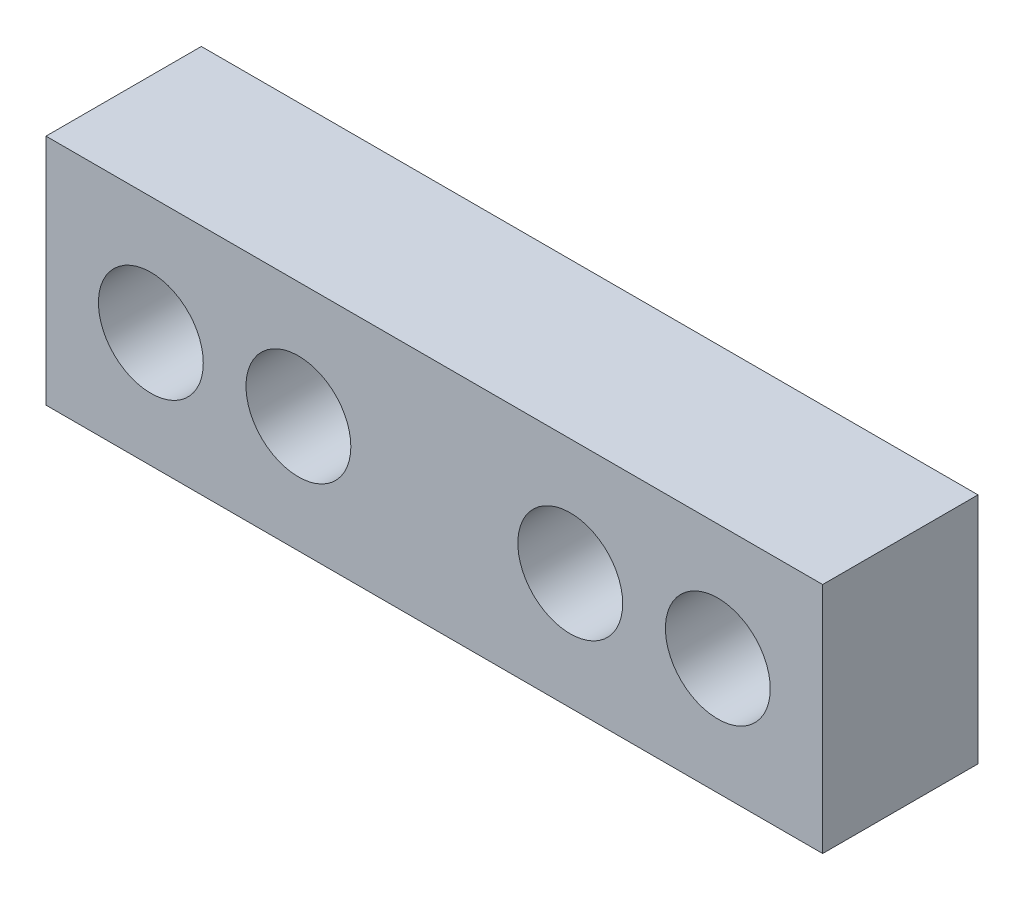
ISO-10303-21;
HEADER;
FILE_DESCRIPTION(('STEP AP214'),'2;1');
FILE_NAME('part.step','',(''),(''),'','','');
FILE_SCHEMA(('AUTOMOTIVE_DESIGN { 1 0 10303 214 1 1 1 1 }'));
ENDSEC;
DATA;
#1=APPLICATION_CONTEXT('core data for automotive mechanical design processes');
#2=APPLICATION_PROTOCOL_DEFINITION('international standard','automotive_design',2000,#1);
#3=PRODUCT_CONTEXT('',#1,'mechanical');
#4=PRODUCT('Part','Part','',(#3));
#5=PRODUCT_RELATED_PRODUCT_CATEGORY('part','',(#4));
#6=PRODUCT_DEFINITION_FORMATION('','',#4);
#7=PRODUCT_DEFINITION_CONTEXT('part definition',#1,'design');
#8=PRODUCT_DEFINITION('design','',#6,#7);
#9=PRODUCT_DEFINITION_SHAPE('','',#8);
#10=(LENGTH_UNIT() NAMED_UNIT(*) SI_UNIT(.MILLI.,.METRE.));
#11=(NAMED_UNIT(*) PLANE_ANGLE_UNIT() SI_UNIT($,.RADIAN.));
#12=(NAMED_UNIT(*) SI_UNIT($,.STERADIAN.) SOLID_ANGLE_UNIT());
#13=UNCERTAINTY_MEASURE_WITH_UNIT(LENGTH_MEASURE(1.E-05),#10,'distance_accuracy_value','');
#14=(GEOMETRIC_REPRESENTATION_CONTEXT(3) GLOBAL_UNCERTAINTY_ASSIGNED_CONTEXT((#13)) GLOBAL_UNIT_ASSIGNED_CONTEXT((#10,
#11,#12)) REPRESENTATION_CONTEXT('',''));
#15=CARTESIAN_POINT('',(0.,0.,0.));
#16=DIRECTION('',(0.,0.,1.));
#17=DIRECTION('',(1.,0.,0.));
#18=AXIS2_PLACEMENT_3D('',#15,#16,#17);
#19=CARTESIAN_POINT('',(-13.5,15.,0.));
#20=DIRECTION('',(0.,0.,1.));
#21=DIRECTION('',(1.,0.,0.));
#22=AXIS2_PLACEMENT_3D('',#19,#20,#21);
#23=PLANE('',#22);
#24=CARTESIAN_POINT('',(-2.5,0.,0.));
#25=DIRECTION('',(0.,0.,-1.));
#26=DIRECTION('',(-1.,0.,0.));
#27=AXIS2_PLACEMENT_3D('',#24,#25,#26);
#28=CIRCLE('',#27,4.5);
#29=CARTESIAN_POINT('',(-2.5,-4.5,0.));
#30=VERTEX_POINT('',#29);
#31=CARTESIAN_POINT('',(-2.5,4.5,0.));
#32=VERTEX_POINT('',#31);
#33=EDGE_CURVE('E124',#30,#32,#28,.T.);
#34=ORIENTED_EDGE('',*,*,#33,.F.);
#35=DIRECTION('',(-1.,0.,0.));
#36=VECTOR('',#35,1.);
#37=CARTESIAN_POINT('',(-2.5,-4.5,0.));
#38=LINE('',#37,#36);
#39=CARTESIAN_POINT('',(20.5,-4.5,0.));
#40=VERTEX_POINT('',#39);
#41=EDGE_CURVE('E137',#40,#30,#38,.T.);
#42=ORIENTED_EDGE('',*,*,#41,.F.);
#43=CARTESIAN_POINT('',(20.5,0.,0.));
#44=DIRECTION('',(0.,0.,-1.));
#45=DIRECTION('',(-1.,0.,0.));
#46=AXIS2_PLACEMENT_3D('',#43,#44,#45);
#47=CIRCLE('',#46,4.5);
#48=CARTESIAN_POINT('',(20.5,4.5,0.));
#49=VERTEX_POINT('',#48);
#50=EDGE_CURVE('E146',#49,#40,#47,.T.);
#51=ORIENTED_EDGE('',*,*,#50,.F.);
#52=DIRECTION('',(1.,0.,0.));
#53=VECTOR('',#52,1.);
#54=CARTESIAN_POINT('',(20.5,4.5,0.));
#55=LINE('',#54,#53);
#56=EDGE_CURVE('E127',#32,#49,#55,.T.);
#57=ORIENTED_EDGE('',*,*,#56,.F.);
#58=EDGE_LOOP('',(#34,#42,#51,#57));
#59=FACE_BOUND('',#58,.T.);
#60=DIRECTION('',(0.,-1.,0.));
#61=VECTOR('',#60,1.);
#62=CARTESIAN_POINT('',(-13.5,15.,0.));
#63=LINE('',#62,#61);
#64=CARTESIAN_POINT('',(-13.5,15.,0.));
#65=VERTEX_POINT('',#64);
#66=CARTESIAN_POINT('',(-13.5,-15.,0.));
#67=VERTEX_POINT('',#66);
#68=EDGE_CURVE('E162',#65,#67,#63,.T.);
#69=ORIENTED_EDGE('',*,*,#68,.F.);
#70=DIRECTION('',(-1.,0.,0.));
#71=VECTOR('',#70,1.);
#72=CARTESIAN_POINT('',(-13.5,15.,0.));
#73=LINE('',#72,#71);
#74=CARTESIAN_POINT('',(86.5,15.,0.));
#75=VERTEX_POINT('',#74);
#76=EDGE_CURVE('E167',#75,#65,#73,.T.);
#77=ORIENTED_EDGE('',*,*,#76,.F.);
#78=DIRECTION('',(0.,1.,0.));
#79=VECTOR('',#78,1.);
#80=CARTESIAN_POINT('',(86.5,15.,0.));
#81=LINE('',#80,#79);
#82=CARTESIAN_POINT('',(86.5,-15.,0.));
#83=VERTEX_POINT('',#82);
#84=EDGE_CURVE('E178',#83,#75,#81,.T.);
#85=ORIENTED_EDGE('',*,*,#84,.F.);
#86=DIRECTION('',(1.,0.,0.));
#87=VECTOR('',#86,1.);
#88=CARTESIAN_POINT('',(-13.5,-15.,0.));
#89=LINE('',#88,#87);
#90=EDGE_CURVE('E176',#67,#83,#89,.T.);
#91=ORIENTED_EDGE('',*,*,#90,.F.);
#92=EDGE_LOOP('',(#69,#77,#85,#91));
#93=FACE_BOUND('',#92,.T.);
#94=CARTESIAN_POINT('',(52.5,0.,0.));
#95=DIRECTION('',(0.,0.,-1.));
#96=DIRECTION('',(1.,0.,0.));
#97=AXIS2_PLACEMENT_3D('',#94,#95,#96);
#98=CIRCLE('',#97,4.5);
#99=CARTESIAN_POINT('',(52.5,-4.5,0.));
#100=VERTEX_POINT('',#99);
#101=CARTESIAN_POINT('',(52.5,4.5,0.));
#102=VERTEX_POINT('',#101);
#103=EDGE_CURVE('E123',#100,#102,#98,.T.);
#104=ORIENTED_EDGE('',*,*,#103,.F.);
#105=DIRECTION('',(-1.,0.,0.));
#106=VECTOR('',#105,1.);
#107=CARTESIAN_POINT('',(75.5,-4.5,0.));
#108=LINE('',#107,#106);
#109=CARTESIAN_POINT('',(75.5,-4.5,0.));
#110=VERTEX_POINT('',#109);
#111=EDGE_CURVE('E120',#110,#100,#108,.T.);
#112=ORIENTED_EDGE('',*,*,#111,.F.);
#113=CARTESIAN_POINT('',(75.5,0.,0.));
#114=DIRECTION('',(0.,0.,-1.));
#115=DIRECTION('',(1.,0.,0.));
#116=AXIS2_PLACEMENT_3D('',#113,#114,#115);
#117=CIRCLE('',#116,4.5);
#118=CARTESIAN_POINT('',(75.5,4.5,0.));
#119=VERTEX_POINT('',#118);
#120=EDGE_CURVE('E34',#119,#110,#117,.T.);
#121=ORIENTED_EDGE('',*,*,#120,.F.);
#122=DIRECTION('',(1.,0.,0.));
#123=VECTOR('',#122,1.);
#124=CARTESIAN_POINT('',(52.5,4.5,0.));
#125=LINE('',#124,#123);
#126=EDGE_CURVE('E29',#102,#119,#125,.T.);
#127=ORIENTED_EDGE('',*,*,#126,.F.);
#128=EDGE_LOOP('',(#104,#112,#121,#127));
#129=FACE_BOUND('',#128,.T.);
#130=ADVANCED_FACE('F14',(#59,#93,#129),#23,.F.);
#131=CARTESIAN_POINT('',(-13.5,15.,20.));
#132=DIRECTION('',(1.,0.,0.));
#133=DIRECTION('',(0.,1.,0.));
#134=AXIS2_PLACEMENT_3D('',#131,#132,#133);
#135=PLANE('',#134);
#136=ORIENTED_EDGE('',*,*,#68,.T.);
#137=DIRECTION('',(0.,0.,-1.));
#138=VECTOR('',#137,1.);
#139=CARTESIAN_POINT('',(-13.5,-15.,20.));
#140=LINE('',#139,#138);
#141=CARTESIAN_POINT('',(-13.5,-15.,20.));
#142=VERTEX_POINT('',#141);
#143=EDGE_CURVE('E9',#142,#67,#140,.T.);
#144=ORIENTED_EDGE('',*,*,#143,.F.);
#145=DIRECTION('',(0.,-1.,0.));
#146=VECTOR('',#145,1.);
#147=CARTESIAN_POINT('',(-13.5,15.,20.));
#148=LINE('',#147,#146);
#149=CARTESIAN_POINT('',(-13.5,15.,20.));
#150=VERTEX_POINT('',#149);
#151=EDGE_CURVE('E163',#150,#142,#148,.T.);
#152=ORIENTED_EDGE('',*,*,#151,.F.);
#153=DIRECTION('',(0.,0.,-1.));
#154=VECTOR('',#153,1.);
#155=CARTESIAN_POINT('',(-13.5,15.,20.));
#156=LINE('',#155,#154);
#157=EDGE_CURVE('E173',#150,#65,#156,.T.);
#158=ORIENTED_EDGE('',*,*,#157,.T.);
#159=EDGE_LOOP('',(#136,#144,#152,#158));
#160=FACE_BOUND('',#159,.T.);
#161=ADVANCED_FACE('F16',(#160),#135,.F.);
#162=CARTESIAN_POINT('',(-13.5,-15.,20.));
#163=DIRECTION('',(0.,1.,0.));
#164=DIRECTION('',(-1.,0.,0.));
#165=AXIS2_PLACEMENT_3D('',#162,#163,#164);
#166=PLANE('',#165);
#167=ORIENTED_EDGE('',*,*,#90,.T.);
#168=DIRECTION('',(0.,0.,-1.));
#169=VECTOR('',#168,1.);
#170=CARTESIAN_POINT('',(86.5,-15.,20.));
#171=LINE('',#170,#169);
#172=CARTESIAN_POINT('',(86.5,-15.,20.));
#173=VERTEX_POINT('',#172);
#174=EDGE_CURVE('E22',#173,#83,#171,.T.);
#175=ORIENTED_EDGE('',*,*,#174,.F.);
#176=DIRECTION('',(1.,0.,0.));
#177=VECTOR('',#176,1.);
#178=CARTESIAN_POINT('',(-13.5,-15.,20.));
#179=LINE('',#178,#177);
#180=EDGE_CURVE('E166',#142,#173,#179,.T.);
#181=ORIENTED_EDGE('',*,*,#180,.F.);
#182=ORIENTED_EDGE('',*,*,#143,.T.);
#183=EDGE_LOOP('',(#167,#175,#181,#182));
#184=FACE_BOUND('',#183,.T.);
#185=ADVANCED_FACE('F205',(#184),#166,.F.);
#186=CARTESIAN_POINT('',(86.5,15.,20.));
#187=DIRECTION('',(-1.,0.,0.));
#188=DIRECTION('',(0.,-1.,0.));
#189=AXIS2_PLACEMENT_3D('',#186,#187,#188);
#190=PLANE('',#189);
#191=ORIENTED_EDGE('',*,*,#84,.T.);
#192=DIRECTION('',(0.,0.,-1.));
#193=VECTOR('',#192,1.);
#194=CARTESIAN_POINT('',(86.5,15.,20.));
#195=LINE('',#194,#193);
#196=CARTESIAN_POINT('',(86.5,15.,20.));
#197=VERTEX_POINT('',#196);
#198=EDGE_CURVE('E183',#197,#75,#195,.T.);
#199=ORIENTED_EDGE('',*,*,#198,.F.);
#200=DIRECTION('',(0.,1.,0.));
#201=VECTOR('',#200,1.);
#202=CARTESIAN_POINT('',(86.5,15.,20.));
#203=LINE('',#202,#201);
#204=EDGE_CURVE('E169',#173,#197,#203,.T.);
#205=ORIENTED_EDGE('',*,*,#204,.F.);
#206=ORIENTED_EDGE('',*,*,#174,.T.);
#207=EDGE_LOOP('',(#191,#199,#205,#206));
#208=FACE_BOUND('',#207,.T.);
#209=ADVANCED_FACE('F190',(#208),#190,.F.);
#210=CARTESIAN_POINT('',(-13.5,15.,20.));
#211=DIRECTION('',(0.,-1.,0.));
#212=DIRECTION('',(0.,0.,-1.));
#213=AXIS2_PLACEMENT_3D('',#210,#211,#212);
#214=PLANE('',#213);
#215=ORIENTED_EDGE('',*,*,#76,.T.);
#216=ORIENTED_EDGE('',*,*,#157,.F.);
#217=DIRECTION('',(-1.,0.,0.));
#218=VECTOR('',#217,1.);
#219=CARTESIAN_POINT('',(-13.5,15.,20.));
#220=LINE('',#219,#218);
#221=EDGE_CURVE('E171',#197,#150,#220,.T.);
#222=ORIENTED_EDGE('',*,*,#221,.F.);
#223=ORIENTED_EDGE('',*,*,#198,.T.);
#224=EDGE_LOOP('',(#215,#216,#222,#223));
#225=FACE_BOUND('',#224,.T.);
#226=ADVANCED_FACE('F198',(#225),#214,.F.);
#227=CARTESIAN_POINT('',(-13.5,15.,20.));
#228=DIRECTION('',(0.,0.,1.));
#229=DIRECTION('',(1.,0.,0.));
#230=AXIS2_PLACEMENT_3D('',#227,#228,#229);
#231=PLANE('',#230);
#232=CARTESIAN_POINT('',(0.,-0.181277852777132,20.));
#233=DIRECTION('',(0.,0.,1.));
#234=DIRECTION('',(1.,0.,0.));
#235=AXIS2_PLACEMENT_3D('',#232,#233,#234);
#236=CIRCLE('',#235,6.75);
#237=CARTESIAN_POINT('',(6.75,-0.181277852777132,20.));
#238=VERTEX_POINT('',#237);
#239=EDGE_CURVE('E239',#238,#238,#236,.T.);
#240=ORIENTED_EDGE('',*,*,#239,.F.);
#241=EDGE_LOOP('',(#240));
#242=FACE_BOUND('',#241,.T.);
#243=CARTESIAN_POINT('',(19.,0.,20.));
#244=DIRECTION('',(0.,0.,1.));
#245=DIRECTION('',(1.,0.,0.));
#246=AXIS2_PLACEMENT_3D('',#243,#244,#245);
#247=CIRCLE('',#246,6.75);
#248=CARTESIAN_POINT('',(25.75,0.,20.));
#249=VERTEX_POINT('',#248);
#250=EDGE_CURVE('E243',#249,#249,#247,.T.);
#251=ORIENTED_EDGE('',*,*,#250,.F.);
#252=EDGE_LOOP('',(#251));
#253=FACE_BOUND('',#252,.T.);
#254=CARTESIAN_POINT('',(54.,0.,20.));
#255=DIRECTION('',(0.,0.,1.));
#256=DIRECTION('',(1.,0.,0.));
#257=AXIS2_PLACEMENT_3D('',#254,#255,#256);
#258=CIRCLE('',#257,6.75);
#259=CARTESIAN_POINT('',(60.75,0.,20.));
#260=VERTEX_POINT('',#259);
#261=EDGE_CURVE('E247',#260,#260,#258,.T.);
#262=ORIENTED_EDGE('',*,*,#261,.F.);
#263=EDGE_LOOP('',(#262));
#264=FACE_BOUND('',#263,.T.);
#265=CARTESIAN_POINT('',(73.,0.,20.));
#266=DIRECTION('',(0.,0.,1.));
#267=DIRECTION('',(1.,0.,0.));
#268=AXIS2_PLACEMENT_3D('',#265,#266,#267);
#269=CIRCLE('',#268,6.75);
#270=CARTESIAN_POINT('',(79.75,0.,20.));
#271=VERTEX_POINT('',#270);
#272=EDGE_CURVE('E250',#271,#271,#269,.T.);
#273=ORIENTED_EDGE('',*,*,#272,.F.);
#274=EDGE_LOOP('',(#273));
#275=FACE_BOUND('',#274,.T.);
#276=ORIENTED_EDGE('',*,*,#151,.T.);
#277=ORIENTED_EDGE('',*,*,#180,.T.);
#278=ORIENTED_EDGE('',*,*,#204,.T.);
#279=ORIENTED_EDGE('',*,*,#221,.T.);
#280=EDGE_LOOP('',(#276,#277,#278,#279));
#281=FACE_BOUND('',#280,.T.);
#282=ADVANCED_FACE('F204',(#242,#253,#264,#275,#281),#231,.T.);
#283=CARTESIAN_POINT('',(-2.5,0.,-2.4));
#284=DIRECTION('',(0.,0.,1.));
#285=DIRECTION('',(1.,0.,0.));
#286=AXIS2_PLACEMENT_3D('',#283,#284,#285);
#287=CYLINDRICAL_SURFACE('',#286,4.5);
#288=ORIENTED_EDGE('',*,*,#33,.T.);
#289=DIRECTION('',(0.,0.,1.));
#290=VECTOR('',#289,1.);
#291=CARTESIAN_POINT('',(-2.5,4.5,-2.4));
#292=LINE('',#291,#290);
#293=CARTESIAN_POINT('',(-2.5,4.5,-2.4));
#294=VERTEX_POINT('',#293);
#295=EDGE_CURVE('E159',#294,#32,#292,.T.);
#296=ORIENTED_EDGE('',*,*,#295,.F.);
#297=CARTESIAN_POINT('',(-2.5,0.,-2.4));
#298=DIRECTION('',(0.,0.,-1.));
#299=DIRECTION('',(-1.,0.,0.));
#300=AXIS2_PLACEMENT_3D('',#297,#298,#299);
#301=CIRCLE('',#300,4.5);
#302=CARTESIAN_POINT('',(-2.5,-4.5,-2.4));
#303=VERTEX_POINT('',#302);
#304=EDGE_CURVE('E133',#303,#294,#301,.T.);
#305=ORIENTED_EDGE('',*,*,#304,.F.);
#306=DIRECTION('',(0.,0.,1.));
#307=VECTOR('',#306,1.);
#308=CARTESIAN_POINT('',(-2.5,-4.5,-2.4));
#309=LINE('',#308,#307);
#310=EDGE_CURVE('E142',#303,#30,#309,.T.);
#311=ORIENTED_EDGE('',*,*,#310,.T.);
#312=EDGE_LOOP('',(#288,#296,#305,#311));
#313=FACE_BOUND('',#312,.T.);
#314=ADVANCED_FACE('F228',(#313),#287,.T.);
#315=CARTESIAN_POINT('',(20.5,4.5,-2.4));
#316=DIRECTION('',(0.,-1.,0.));
#317=DIRECTION('',(1.,0.,0.));
#318=AXIS2_PLACEMENT_3D('',#315,#316,#317);
#319=PLANE('',#318);
#320=ORIENTED_EDGE('',*,*,#56,.T.);
#321=DIRECTION('',(0.,0.,1.));
#322=VECTOR('',#321,1.);
#323=CARTESIAN_POINT('',(20.5,4.5,-2.4));
#324=LINE('',#323,#322);
#325=CARTESIAN_POINT('',(20.5,4.5,-2.4));
#326=VERTEX_POINT('',#325);
#327=EDGE_CURVE('E156',#326,#49,#324,.T.);
#328=ORIENTED_EDGE('',*,*,#327,.F.);
#329=DIRECTION('',(1.,0.,0.));
#330=VECTOR('',#329,1.);
#331=CARTESIAN_POINT('',(20.5,4.5,-2.4));
#332=LINE('',#331,#330);
#333=EDGE_CURVE('E136',#294,#326,#332,.T.);
#334=ORIENTED_EDGE('',*,*,#333,.F.);
#335=ORIENTED_EDGE('',*,*,#295,.T.);
#336=EDGE_LOOP('',(#320,#328,#334,#335));
#337=FACE_BOUND('',#336,.T.);
#338=ADVANCED_FACE('F234',(#337),#319,.F.);
#339=CARTESIAN_POINT('',(20.5,0.,-2.4));
#340=DIRECTION('',(0.,0.,1.));
#341=DIRECTION('',(1.,0.,0.));
#342=AXIS2_PLACEMENT_3D('',#339,#340,#341);
#343=CYLINDRICAL_SURFACE('',#342,4.5);
#344=ORIENTED_EDGE('',*,*,#50,.T.);
#345=DIRECTION('',(0.,0.,1.));
#346=VECTOR('',#345,1.);
#347=CARTESIAN_POINT('',(20.5,-4.5,-2.4));
#348=LINE('',#347,#346);
#349=CARTESIAN_POINT('',(20.5,-4.5,-2.4));
#350=VERTEX_POINT('',#349);
#351=EDGE_CURVE('E153',#350,#40,#348,.T.);
#352=ORIENTED_EDGE('',*,*,#351,.F.);
#353=CARTESIAN_POINT('',(20.5,0.,-2.4));
#354=DIRECTION('',(0.,0.,-1.));
#355=DIRECTION('',(-1.,0.,0.));
#356=AXIS2_PLACEMENT_3D('',#353,#354,#355);
#357=CIRCLE('',#356,4.5);
#358=EDGE_CURVE('E139',#326,#350,#357,.T.);
#359=ORIENTED_EDGE('',*,*,#358,.F.);
#360=ORIENTED_EDGE('',*,*,#327,.T.);
#361=EDGE_LOOP('',(#344,#352,#359,#360));
#362=FACE_BOUND('',#361,.T.);
#363=ADVANCED_FACE('F302',(#362),#343,.T.);
#364=CARTESIAN_POINT('',(-2.5,-4.5,-2.4));
#365=DIRECTION('',(0.,1.,0.));
#366=DIRECTION('',(-1.,0.,0.));
#367=AXIS2_PLACEMENT_3D('',#364,#365,#366);
#368=PLANE('',#367);
#369=ORIENTED_EDGE('',*,*,#41,.T.);
#370=ORIENTED_EDGE('',*,*,#310,.F.);
#371=DIRECTION('',(-1.,0.,0.));
#372=VECTOR('',#371,1.);
#373=CARTESIAN_POINT('',(-2.5,-4.5,-2.4));
#374=LINE('',#373,#372);
#375=EDGE_CURVE('E141',#350,#303,#374,.T.);
#376=ORIENTED_EDGE('',*,*,#375,.F.);
#377=ORIENTED_EDGE('',*,*,#351,.T.);
#378=EDGE_LOOP('',(#369,#370,#376,#377));
#379=FACE_BOUND('',#378,.T.);
#380=ADVANCED_FACE('F298',(#379),#368,.F.);
#381=CARTESIAN_POINT('',(-2.5,0.,-2.4));
#382=DIRECTION('',(0.,0.,-1.));
#383=DIRECTION('',(-1.,0.,0.));
#384=AXIS2_PLACEMENT_3D('',#381,#382,#383);
#385=PLANE('',#384);
#386=CARTESIAN_POINT('',(0.,-0.181277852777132,-2.4));
#387=DIRECTION('',(0.,0.,1.));
#388=DIRECTION('',(1.,0.,0.));
#389=AXIS2_PLACEMENT_3D('',#386,#387,#388);
#390=CIRCLE('',#389,4.1);
#391=CARTESIAN_POINT('',(4.1,-0.181277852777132,-2.4));
#392=VERTEX_POINT('',#391);
#393=EDGE_CURVE('E537',#392,#392,#390,.T.);
#394=ORIENTED_EDGE('',*,*,#393,.T.);
#395=EDGE_LOOP('',(#394));
#396=FACE_BOUND('',#395,.T.);
#397=CARTESIAN_POINT('',(19.,0.,-2.4));
#398=DIRECTION('',(0.,0.,1.));
#399=DIRECTION('',(1.,0.,0.));
#400=AXIS2_PLACEMENT_3D('',#397,#398,#399);
#401=CIRCLE('',#400,4.1);
#402=CARTESIAN_POINT('',(23.1,0.,-2.4));
#403=VERTEX_POINT('',#402);
#404=EDGE_CURVE('E547',#403,#403,#401,.T.);
#405=ORIENTED_EDGE('',*,*,#404,.T.);
#406=EDGE_LOOP('',(#405));
#407=FACE_BOUND('',#406,.T.);
#408=ORIENTED_EDGE('',*,*,#304,.T.);
#409=ORIENTED_EDGE('',*,*,#333,.T.);
#410=ORIENTED_EDGE('',*,*,#358,.T.);
#411=ORIENTED_EDGE('',*,*,#375,.T.);
#412=EDGE_LOOP('',(#408,#409,#410,#411));
#413=FACE_BOUND('',#412,.T.);
#414=ADVANCED_FACE('F295',(#396,#407,#413),#385,.T.);
#415=CARTESIAN_POINT('',(52.5,0.,-2.4));
#416=DIRECTION('',(0.,0.,1.));
#417=DIRECTION('',(1.,0.,0.));
#418=AXIS2_PLACEMENT_3D('',#415,#416,#417);
#419=CYLINDRICAL_SURFACE('',#418,4.5);
#420=ORIENTED_EDGE('',*,*,#103,.T.);
#421=DIRECTION('',(0.,0.,1.));
#422=VECTOR('',#421,1.);
#423=CARTESIAN_POINT('',(52.5,4.5,-2.4));
#424=LINE('',#423,#422);
#425=CARTESIAN_POINT('',(52.5,4.5,-2.4));
#426=VERTEX_POINT('',#425);
#427=EDGE_CURVE('E104',#426,#102,#424,.T.);
#428=ORIENTED_EDGE('',*,*,#427,.F.);
#429=CARTESIAN_POINT('',(52.5,0.,-2.4));
#430=DIRECTION('',(0.,0.,-1.));
#431=DIRECTION('',(1.,0.,0.));
#432=AXIS2_PLACEMENT_3D('',#429,#430,#431);
#433=CIRCLE('',#432,4.5);
#434=CARTESIAN_POINT('',(52.5,-4.5,-2.4));
#435=VERTEX_POINT('',#434);
#436=EDGE_CURVE('E111',#435,#426,#433,.T.);
#437=ORIENTED_EDGE('',*,*,#436,.F.);
#438=DIRECTION('',(0.,0.,1.));
#439=VECTOR('',#438,1.);
#440=CARTESIAN_POINT('',(52.5,-4.5,-2.4));
#441=LINE('',#440,#439);
#442=EDGE_CURVE('E270',#435,#100,#441,.T.);
#443=ORIENTED_EDGE('',*,*,#442,.T.);
#444=EDGE_LOOP('',(#420,#428,#437,#443));
#445=FACE_BOUND('',#444,.T.);
#446=ADVANCED_FACE('F122',(#445),#419,.T.);
#447=CARTESIAN_POINT('',(52.5,4.5,-2.4));
#448=DIRECTION('',(0.,-1.,0.));
#449=DIRECTION('',(1.,0.,0.));
#450=AXIS2_PLACEMENT_3D('',#447,#448,#449);
#451=PLANE('',#450);
#452=ORIENTED_EDGE('',*,*,#126,.T.);
#453=DIRECTION('',(0.,0.,1.));
#454=VECTOR('',#453,1.);
#455=CARTESIAN_POINT('',(75.5,4.5,-2.4));
#456=LINE('',#455,#454);
#457=CARTESIAN_POINT('',(75.5,4.5,-2.4));
#458=VERTEX_POINT('',#457);
#459=EDGE_CURVE('E107',#458,#119,#456,.T.);
#460=ORIENTED_EDGE('',*,*,#459,.F.);
#461=DIRECTION('',(1.,0.,0.));
#462=VECTOR('',#461,1.);
#463=CARTESIAN_POINT('',(52.5,4.5,-2.4));
#464=LINE('',#463,#462);
#465=EDGE_CURVE('E100',#426,#458,#464,.T.);
#466=ORIENTED_EDGE('',*,*,#465,.F.);
#467=ORIENTED_EDGE('',*,*,#427,.T.);
#468=EDGE_LOOP('',(#452,#460,#466,#467));
#469=FACE_BOUND('',#468,.T.);
#470=ADVANCED_FACE('F102',(#469),#451,.F.);
#471=CARTESIAN_POINT('',(75.5,0.,-2.4));
#472=DIRECTION('',(0.,0.,1.));
#473=DIRECTION('',(1.,0.,0.));
#474=AXIS2_PLACEMENT_3D('',#471,#472,#473);
#475=CYLINDRICAL_SURFACE('',#474,4.5);
#476=ORIENTED_EDGE('',*,*,#120,.T.);
#477=DIRECTION('',(0.,0.,1.));
#478=VECTOR('',#477,1.);
#479=CARTESIAN_POINT('',(75.5,-4.5,-2.4));
#480=LINE('',#479,#478);
#481=CARTESIAN_POINT('',(75.5,-4.5,-2.4));
#482=VERTEX_POINT('',#481);
#483=EDGE_CURVE('E129',#482,#110,#480,.T.);
#484=ORIENTED_EDGE('',*,*,#483,.F.);
#485=CARTESIAN_POINT('',(75.5,0.,-2.4));
#486=DIRECTION('',(0.,0.,-1.));
#487=DIRECTION('',(1.,0.,0.));
#488=AXIS2_PLACEMENT_3D('',#485,#486,#487);
#489=CIRCLE('',#488,4.5);
#490=EDGE_CURVE('E110',#458,#482,#489,.T.);
#491=ORIENTED_EDGE('',*,*,#490,.F.);
#492=ORIENTED_EDGE('',*,*,#459,.T.);
#493=EDGE_LOOP('',(#476,#484,#491,#492));
#494=FACE_BOUND('',#493,.T.);
#495=ADVANCED_FACE('F281',(#494),#475,.T.);
#496=CARTESIAN_POINT('',(75.5,-4.5,-2.4));
#497=DIRECTION('',(0.,1.,0.));
#498=DIRECTION('',(-1.,0.,0.));
#499=AXIS2_PLACEMENT_3D('',#496,#497,#498);
#500=PLANE('',#499);
#501=ORIENTED_EDGE('',*,*,#111,.T.);
#502=ORIENTED_EDGE('',*,*,#442,.F.);
#503=DIRECTION('',(-1.,0.,0.));
#504=VECTOR('',#503,1.);
#505=CARTESIAN_POINT('',(75.5,-4.5,-2.4));
#506=LINE('',#505,#504);
#507=EDGE_CURVE('E116',#482,#435,#506,.T.);
#508=ORIENTED_EDGE('',*,*,#507,.F.);
#509=ORIENTED_EDGE('',*,*,#483,.T.);
#510=EDGE_LOOP('',(#501,#502,#508,#509));
#511=FACE_BOUND('',#510,.T.);
#512=ADVANCED_FACE('F279',(#511),#500,.F.);
#513=CARTESIAN_POINT('',(52.5,0.,-2.4));
#514=DIRECTION('',(0.,0.,1.));
#515=DIRECTION('',(1.,0.,0.));
#516=AXIS2_PLACEMENT_3D('',#513,#514,#515);
#517=PLANE('',#516);
#518=CARTESIAN_POINT('',(54.,0.,-2.4));
#519=DIRECTION('',(0.,0.,1.));
#520=DIRECTION('',(1.,0.,0.));
#521=AXIS2_PLACEMENT_3D('',#518,#519,#520);
#522=CIRCLE('',#521,4.1);
#523=CARTESIAN_POINT('',(58.1,0.,-2.4));
#524=VERTEX_POINT('',#523);
#525=EDGE_CURVE('E253',#524,#524,#522,.T.);
#526=ORIENTED_EDGE('',*,*,#525,.T.);
#527=EDGE_LOOP('',(#526));
#528=FACE_BOUND('',#527,.T.);
#529=CARTESIAN_POINT('',(73.,0.,-2.4));
#530=DIRECTION('',(0.,0.,1.));
#531=DIRECTION('',(1.,0.,0.));
#532=AXIS2_PLACEMENT_3D('',#529,#530,#531);
#533=CIRCLE('',#532,4.1);
#534=CARTESIAN_POINT('',(77.1,0.,-2.4));
#535=VERTEX_POINT('',#534);
#536=EDGE_CURVE('E265',#535,#535,#533,.T.);
#537=ORIENTED_EDGE('',*,*,#536,.T.);
#538=EDGE_LOOP('',(#537));
#539=FACE_BOUND('',#538,.T.);
#540=ORIENTED_EDGE('',*,*,#436,.T.);
#541=ORIENTED_EDGE('',*,*,#465,.T.);
#542=ORIENTED_EDGE('',*,*,#490,.T.);
#543=ORIENTED_EDGE('',*,*,#507,.T.);
#544=EDGE_LOOP('',(#540,#541,#542,#543));
#545=FACE_BOUND('',#544,.T.);
#546=ADVANCED_FACE('F114',(#528,#539,#545),#517,.F.);
#547=CARTESIAN_POINT('',(73.,0.,20.));
#548=DIRECTION('',(0.,0.,1.));
#549=DIRECTION('',(1.,0.,0.));
#550=AXIS2_PLACEMENT_3D('',#547,#548,#549);
#551=CYLINDRICAL_SURFACE('',#550,4.1);
#552=ORIENTED_EDGE('',*,*,#536,.F.);
#553=EDGE_LOOP('',(#552));
#554=FACE_BOUND('',#553,.T.);
#555=CARTESIAN_POINT('',(73.,0.,5.));
#556=DIRECTION('',(0.,0.,1.));
#557=DIRECTION('',(1.,0.,0.));
#558=AXIS2_PLACEMENT_3D('',#555,#556,#557);
#559=CIRCLE('',#558,4.1);
#560=CARTESIAN_POINT('',(77.1,0.,5.));
#561=VERTEX_POINT('',#560);
#562=EDGE_CURVE('E256',#561,#561,#559,.T.);
#563=ORIENTED_EDGE('',*,*,#562,.T.);
#564=EDGE_LOOP('',(#563));
#565=FACE_BOUND('',#564,.T.);
#566=ADVANCED_FACE('F405',(#554,#565),#551,.F.);
#567=CARTESIAN_POINT('',(77.1,0.,5.));
#568=DIRECTION('',(0.,0.,-1.));
#569=DIRECTION('',(-1.,0.,0.));
#570=AXIS2_PLACEMENT_3D('',#567,#568,#569);
#571=PLANE('',#570);
#572=ORIENTED_EDGE('',*,*,#562,.F.);
#573=EDGE_LOOP('',(#572));
#574=FACE_BOUND('',#573,.T.);
#575=CARTESIAN_POINT('',(73.,0.,5.));
#576=DIRECTION('',(0.,0.,1.));
#577=DIRECTION('',(1.,0.,0.));
#578=AXIS2_PLACEMENT_3D('',#575,#576,#577);
#579=CIRCLE('',#578,6.75);
#580=CARTESIAN_POINT('',(79.75,0.,5.));
#581=VERTEX_POINT('',#580);
#582=EDGE_CURVE('E252',#581,#581,#579,.T.);
#583=ORIENTED_EDGE('',*,*,#582,.T.);
#584=EDGE_LOOP('',(#583));
#585=FACE_BOUND('',#584,.T.);
#586=ADVANCED_FACE('F412',(#574,#585),#571,.F.);
#587=CARTESIAN_POINT('',(73.,0.,20.));
#588=DIRECTION('',(0.,0.,1.));
#589=DIRECTION('',(1.,0.,0.));
#590=AXIS2_PLACEMENT_3D('',#587,#588,#589);
#591=CYLINDRICAL_SURFACE('',#590,6.75);
#592=ORIENTED_EDGE('',*,*,#582,.F.);
#593=EDGE_LOOP('',(#592));
#594=FACE_BOUND('',#593,.T.);
#595=ORIENTED_EDGE('',*,*,#272,.T.);
#596=EDGE_LOOP('',(#595));
#597=FACE_BOUND('',#596,.T.);
#598=ADVANCED_FACE('F421',(#594,#597),#591,.F.);
#599=CARTESIAN_POINT('',(54.,0.,20.));
#600=DIRECTION('',(0.,0.,1.));
#601=DIRECTION('',(1.,0.,0.));
#602=AXIS2_PLACEMENT_3D('',#599,#600,#601);
#603=CYLINDRICAL_SURFACE('',#602,4.1);
#604=ORIENTED_EDGE('',*,*,#525,.F.);
#605=EDGE_LOOP('',(#604));
#606=FACE_BOUND('',#605,.T.);
#607=CARTESIAN_POINT('',(54.,0.,5.));
#608=DIRECTION('',(0.,0.,1.));
#609=DIRECTION('',(1.,0.,0.));
#610=AXIS2_PLACEMENT_3D('',#607,#608,#609);
#611=CIRCLE('',#610,4.1);
#612=CARTESIAN_POINT('',(58.1,0.,5.));
#613=VERTEX_POINT('',#612);
#614=EDGE_CURVE('E259',#613,#613,#611,.T.);
#615=ORIENTED_EDGE('',*,*,#614,.T.);
#616=EDGE_LOOP('',(#615));
#617=FACE_BOUND('',#616,.T.);
#618=ADVANCED_FACE('F430',(#606,#617),#603,.F.);
#619=CARTESIAN_POINT('',(58.1,0.,5.));
#620=DIRECTION('',(0.,0.,-1.));
#621=DIRECTION('',(-1.,0.,0.));
#622=AXIS2_PLACEMENT_3D('',#619,#620,#621);
#623=PLANE('',#622);
#624=ORIENTED_EDGE('',*,*,#614,.F.);
#625=EDGE_LOOP('',(#624));
#626=FACE_BOUND('',#625,.T.);
#627=CARTESIAN_POINT('',(54.,0.,5.));
#628=DIRECTION('',(0.,0.,1.));
#629=DIRECTION('',(1.,0.,0.));
#630=AXIS2_PLACEMENT_3D('',#627,#628,#629);
#631=CIRCLE('',#630,6.75);
#632=CARTESIAN_POINT('',(60.75,0.,5.));
#633=VERTEX_POINT('',#632);
#634=EDGE_CURVE('E551',#633,#633,#631,.T.);
#635=ORIENTED_EDGE('',*,*,#634,.T.);
#636=EDGE_LOOP('',(#635));
#637=FACE_BOUND('',#636,.T.);
#638=ADVANCED_FACE('F439',(#626,#637),#623,.F.);
#639=CARTESIAN_POINT('',(54.,0.,20.));
#640=DIRECTION('',(0.,0.,1.));
#641=DIRECTION('',(1.,0.,0.));
#642=AXIS2_PLACEMENT_3D('',#639,#640,#641);
#643=CYLINDRICAL_SURFACE('',#642,6.75);
#644=ORIENTED_EDGE('',*,*,#634,.F.);
#645=EDGE_LOOP('',(#644));
#646=FACE_BOUND('',#645,.T.);
#647=ORIENTED_EDGE('',*,*,#261,.T.);
#648=EDGE_LOOP('',(#647));
#649=FACE_BOUND('',#648,.T.);
#650=ADVANCED_FACE('F448',(#646,#649),#643,.F.);
#651=CARTESIAN_POINT('',(19.,0.,20.));
#652=DIRECTION('',(0.,0.,1.));
#653=DIRECTION('',(1.,0.,0.));
#654=AXIS2_PLACEMENT_3D('',#651,#652,#653);
#655=CYLINDRICAL_SURFACE('',#654,4.1);
#656=ORIENTED_EDGE('',*,*,#404,.F.);
#657=EDGE_LOOP('',(#656));
#658=FACE_BOUND('',#657,.T.);
#659=CARTESIAN_POINT('',(19.,0.,5.));
#660=DIRECTION('',(0.,0.,1.));
#661=DIRECTION('',(1.,0.,0.));
#662=AXIS2_PLACEMENT_3D('',#659,#660,#661);
#663=CIRCLE('',#662,4.1);
#664=CARTESIAN_POINT('',(23.1,0.,5.));
#665=VERTEX_POINT('',#664);
#666=EDGE_CURVE('E544',#665,#665,#663,.T.);
#667=ORIENTED_EDGE('',*,*,#666,.T.);
#668=EDGE_LOOP('',(#667));
#669=FACE_BOUND('',#668,.T.);
#670=ADVANCED_FACE('F457',(#658,#669),#655,.F.);
#671=CARTESIAN_POINT('',(23.1,0.,5.));
#672=DIRECTION('',(0.,0.,-1.));
#673=DIRECTION('',(-1.,0.,0.));
#674=AXIS2_PLACEMENT_3D('',#671,#672,#673);
#675=PLANE('',#674);
#676=ORIENTED_EDGE('',*,*,#666,.F.);
#677=EDGE_LOOP('',(#676));
#678=FACE_BOUND('',#677,.T.);
#679=CARTESIAN_POINT('',(19.,0.,5.));
#680=DIRECTION('',(0.,0.,1.));
#681=DIRECTION('',(1.,0.,0.));
#682=AXIS2_PLACEMENT_3D('',#679,#680,#681);
#683=CIRCLE('',#682,6.75);
#684=CARTESIAN_POINT('',(25.75,0.,5.));
#685=VERTEX_POINT('',#684);
#686=EDGE_CURVE('E541',#685,#685,#683,.T.);
#687=ORIENTED_EDGE('',*,*,#686,.T.);
#688=EDGE_LOOP('',(#687));
#689=FACE_BOUND('',#688,.T.);
#690=ADVANCED_FACE('F466',(#678,#689),#675,.F.);
#691=CARTESIAN_POINT('',(19.,0.,20.));
#692=DIRECTION('',(0.,0.,1.));
#693=DIRECTION('',(1.,0.,0.));
#694=AXIS2_PLACEMENT_3D('',#691,#692,#693);
#695=CYLINDRICAL_SURFACE('',#694,6.75);
#696=ORIENTED_EDGE('',*,*,#686,.F.);
#697=EDGE_LOOP('',(#696));
#698=FACE_BOUND('',#697,.T.);
#699=ORIENTED_EDGE('',*,*,#250,.T.);
#700=EDGE_LOOP('',(#699));
#701=FACE_BOUND('',#700,.T.);
#702=ADVANCED_FACE('F475',(#698,#701),#695,.F.);
#703=CARTESIAN_POINT('',(0.,-0.181277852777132,20.));
#704=DIRECTION('',(0.,0.,1.));
#705=DIRECTION('',(1.,0.,0.));
#706=AXIS2_PLACEMENT_3D('',#703,#704,#705);
#707=CYLINDRICAL_SURFACE('',#706,4.1);
#708=ORIENTED_EDGE('',*,*,#393,.F.);
#709=EDGE_LOOP('',(#708));
#710=FACE_BOUND('',#709,.T.);
#711=CARTESIAN_POINT('',(0.,-0.181277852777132,5.));
#712=DIRECTION('',(0.,0.,1.));
#713=DIRECTION('',(1.,0.,0.));
#714=AXIS2_PLACEMENT_3D('',#711,#712,#713);
#715=CIRCLE('',#714,4.1);
#716=CARTESIAN_POINT('',(4.1,-0.181277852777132,5.));
#717=VERTEX_POINT('',#716);
#718=EDGE_CURVE('E532',#717,#717,#715,.T.);
#719=ORIENTED_EDGE('',*,*,#718,.T.);
#720=EDGE_LOOP('',(#719));
#721=FACE_BOUND('',#720,.T.);
#722=ADVANCED_FACE('F484',(#710,#721),#707,.F.);
#723=CARTESIAN_POINT('',(4.1,-0.181277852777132,5.));
#724=DIRECTION('',(0.,0.,-1.));
#725=DIRECTION('',(-1.,0.,0.));
#726=AXIS2_PLACEMENT_3D('',#723,#724,#725);
#727=PLANE('',#726);
#728=ORIENTED_EDGE('',*,*,#718,.F.);
#729=EDGE_LOOP('',(#728));
#730=FACE_BOUND('',#729,.T.);
#731=CARTESIAN_POINT('',(0.,-0.181277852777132,5.));
#732=DIRECTION('',(0.,0.,1.));
#733=DIRECTION('',(1.,0.,0.));
#734=AXIS2_PLACEMENT_3D('',#731,#732,#733);
#735=CIRCLE('',#734,6.75);
#736=CARTESIAN_POINT('',(6.75,-0.181277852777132,5.));
#737=VERTEX_POINT('',#736);
#738=EDGE_CURVE('E530',#737,#737,#735,.T.);
#739=ORIENTED_EDGE('',*,*,#738,.T.);
#740=EDGE_LOOP('',(#739));
#741=FACE_BOUND('',#740,.T.);
#742=ADVANCED_FACE('F493',(#730,#741),#727,.F.);
#743=CARTESIAN_POINT('',(0.,-0.181277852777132,20.));
#744=DIRECTION('',(0.,0.,1.));
#745=DIRECTION('',(1.,0.,0.));
#746=AXIS2_PLACEMENT_3D('',#743,#744,#745);
#747=CYLINDRICAL_SURFACE('',#746,6.75);
#748=ORIENTED_EDGE('',*,*,#738,.F.);
#749=EDGE_LOOP('',(#748));
#750=FACE_BOUND('',#749,.T.);
#751=ORIENTED_EDGE('',*,*,#239,.T.);
#752=EDGE_LOOP('',(#751));
#753=FACE_BOUND('',#752,.T.);
#754=ADVANCED_FACE('F502',(#750,#753),#747,.F.);
#755=CLOSED_SHELL('',(#130,#161,#185,#209,#226,#282,#314,#338,#363,#380,#414,#446,#470,#495,
#512,#546,#566,#586,#598,#618,#638,#650,#670,#690,#702,#722,#742,#754));
#756=MANIFOLD_SOLID_BREP('B1',#755);
#757=ADVANCED_BREP_SHAPE_REPRESENTATION('',(#18,#756),#14);
#758=SHAPE_DEFINITION_REPRESENTATION(#9,#757);
ENDSEC;
END-ISO-10303-21;
